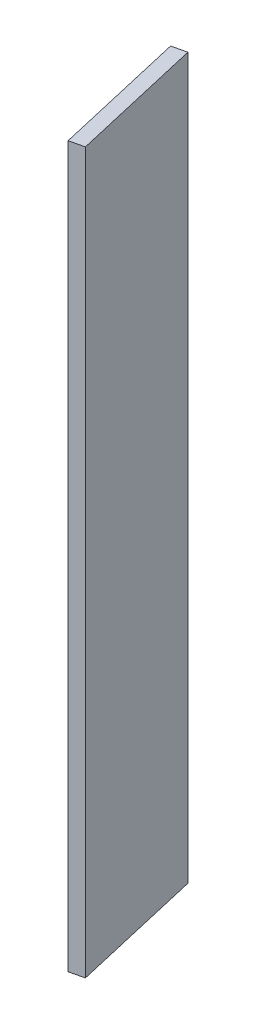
from build123d import *

# Parameters (mm, degrees)
SALIENTE_EXTRUIR1_DEPTH = 500


with BuildPart() as part:
    # Croquis2 → Saliente-Extruir1 (new body)
    with BuildSketch(Plane(origin=(0, 0, 0), x_dir=(1, 0, 0), z_dir=(0, 1, 0))):
        Polygon((390, 0), (411.361653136, -92.567163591), (401.617741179, -94.815758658), (380.256088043, -2.248595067), align=None)
    extrude(amount=SALIENTE_EXTRUIR1_DEPTH)


solid = part.part
